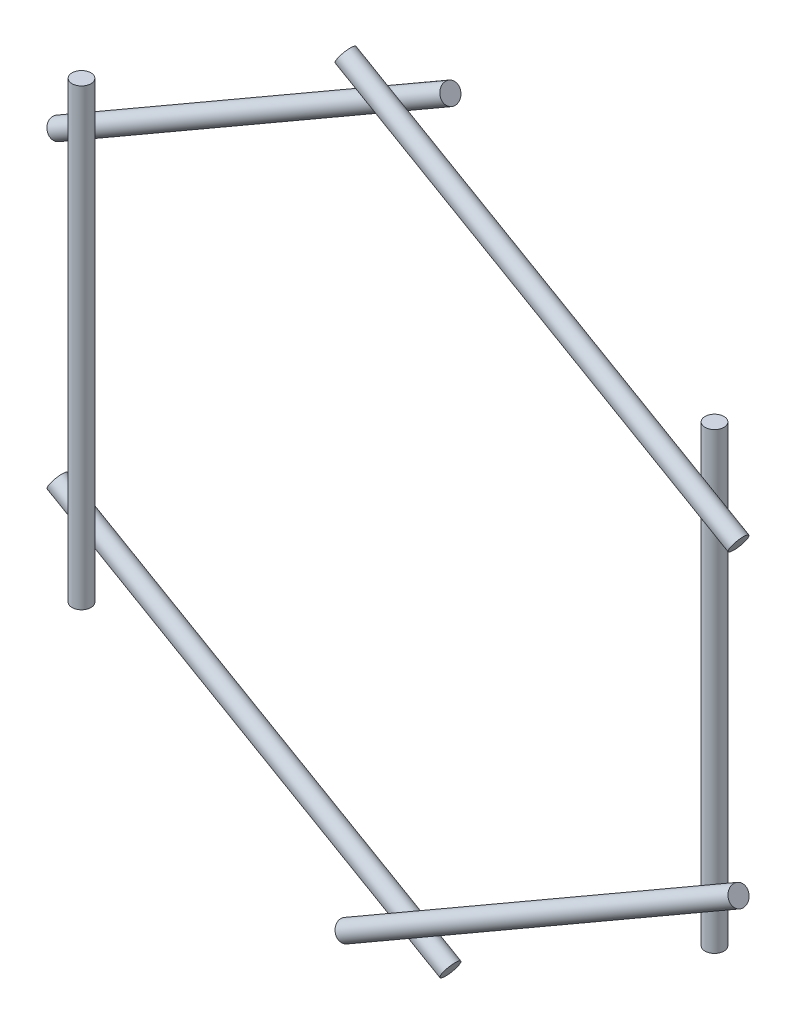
ISO-10303-21;
HEADER;
FILE_DESCRIPTION(('STEP AP214'),'2;1');
FILE_NAME('part.step','',(''),(''),'','','');
FILE_SCHEMA(('AUTOMOTIVE_DESIGN { 1 0 10303 214 1 1 1 1 }'));
ENDSEC;
DATA;
#1=APPLICATION_CONTEXT('core data for automotive mechanical design processes');
#2=APPLICATION_PROTOCOL_DEFINITION('international standard','automotive_design',2000,#1);
#3=PRODUCT_CONTEXT('',#1,'mechanical');
#4=PRODUCT('Part','Part','',(#3));
#5=PRODUCT_RELATED_PRODUCT_CATEGORY('part','',(#4));
#6=PRODUCT_DEFINITION_FORMATION('','',#4);
#7=PRODUCT_DEFINITION_CONTEXT('part definition',#1,'design');
#8=PRODUCT_DEFINITION('design','',#6,#7);
#9=PRODUCT_DEFINITION_SHAPE('','',#8);
#10=(LENGTH_UNIT() NAMED_UNIT(*) SI_UNIT(.MILLI.,.METRE.));
#11=(NAMED_UNIT(*) PLANE_ANGLE_UNIT() SI_UNIT($,.RADIAN.));
#12=(NAMED_UNIT(*) SI_UNIT($,.STERADIAN.) SOLID_ANGLE_UNIT());
#13=UNCERTAINTY_MEASURE_WITH_UNIT(LENGTH_MEASURE(1.E-05),#10,'distance_accuracy_value','');
#14=(GEOMETRIC_REPRESENTATION_CONTEXT(3) GLOBAL_UNCERTAINTY_ASSIGNED_CONTEXT((#13)) GLOBAL_UNIT_ASSIGNED_CONTEXT((#10,
#11,#12)) REPRESENTATION_CONTEXT('',''));
#15=CARTESIAN_POINT('',(0.,0.,0.));
#16=DIRECTION('',(0.,0.,1.));
#17=DIRECTION('',(1.,0.,0.));
#18=AXIS2_PLACEMENT_3D('',#15,#16,#17);
#19=CARTESIAN_POINT('',(-28.8415031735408,-254.845051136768,6.35));
#20=DIRECTION('',(0.866025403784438,0.500000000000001,0.));
#21=DIRECTION('',(-0.500000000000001,0.866025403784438,0.));
#22=AXIS2_PLACEMENT_3D('',#19,#20,#21);
#23=CYLINDRICAL_SURFACE('',#22,6.35);
#24=CARTESIAN_POINT('',(-28.8415031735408,-254.845051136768,6.35));
#25=DIRECTION('',(-0.866025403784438,-0.5,0.));
#26=DIRECTION('',(0.5,-0.866025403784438,0.));
#27=AXIS2_PLACEMENT_3D('',#24,#25,#26);
#28=CIRCLE('',#27,6.35);
#29=CARTESIAN_POINT('',(-25.6665031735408,-260.344312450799,6.35));
#30=VERTEX_POINT('',#29);
#31=EDGE_CURVE('E60',#30,#30,#28,.T.);
#32=ORIENTED_EDGE('',*,*,#31,.F.);
#33=EDGE_LOOP('',(#32));
#34=FACE_BOUND('',#33,.T.);
#35=CARTESIAN_POINT('',(235.123039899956,-102.445051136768,6.35));
#36=DIRECTION('',(-0.866025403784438,-0.5,0.));
#37=DIRECTION('',(0.5,-0.866025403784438,0.));
#38=AXIS2_PLACEMENT_3D('',#35,#36,#37);
#39=CIRCLE('',#38,6.35);
#40=CARTESIAN_POINT('',(238.298039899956,-107.944312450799,6.35));
#41=VERTEX_POINT('',#40);
#42=EDGE_CURVE('E11',#41,#41,#39,.T.);
#43=ORIENTED_EDGE('',*,*,#42,.T.);
#44=EDGE_LOOP('',(#43));
#45=FACE_BOUND('',#44,.T.);
#46=ADVANCED_FACE('F56',(#34,#45),#23,.T.);
#47=CARTESIAN_POINT('',(-28.8415031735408,-254.845051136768,6.35));
#48=DIRECTION('',(-0.866025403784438,-0.5,0.));
#49=DIRECTION('',(0.5,-0.866025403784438,0.));
#50=AXIS2_PLACEMENT_3D('',#47,#48,#49);
#51=PLANE('',#50);
#52=ORIENTED_EDGE('',*,*,#31,.T.);
#53=EDGE_LOOP('',(#52));
#54=FACE_BOUND('',#53,.T.);
#55=ADVANCED_FACE('F58',(#54),#51,.T.);
#56=CARTESIAN_POINT('',(235.123039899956,-102.445051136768,6.35));
#57=DIRECTION('',(-0.866025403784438,-0.5,0.));
#58=DIRECTION('',(0.5,-0.866025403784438,0.));
#59=AXIS2_PLACEMENT_3D('',#56,#57,#58);
#60=PLANE('',#59);
#61=ORIENTED_EDGE('',*,*,#42,.F.);
#62=EDGE_LOOP('',(#61));
#63=FACE_BOUND('',#62,.T.);
#64=ADVANCED_FACE('F81',(#63),#60,.F.);
#65=CLOSED_SHELL('',(#46,#55,#64));
#66=MANIFOLD_SOLID_BREP('B2',#65);
#67=CARTESIAN_POINT('',(-235.123039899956,102.445051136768,-6.35));
#68=DIRECTION('',(0.866025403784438,0.500000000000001,0.));
#69=DIRECTION('',(-0.500000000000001,0.866025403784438,0.));
#70=AXIS2_PLACEMENT_3D('',#67,#68,#69);
#71=CYLINDRICAL_SURFACE('',#70,6.35);
#72=CARTESIAN_POINT('',(-235.123039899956,102.445051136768,-6.35));
#73=DIRECTION('',(-0.866025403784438,-0.5,0.));
#74=DIRECTION('',(0.5,-0.866025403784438,0.));
#75=AXIS2_PLACEMENT_3D('',#72,#73,#74);
#76=CIRCLE('',#75,6.35);
#77=CARTESIAN_POINT('',(-231.948039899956,96.9457898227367,-6.35));
#78=VERTEX_POINT('',#77);
#79=EDGE_CURVE('E55',#78,#78,#76,.T.);
#80=ORIENTED_EDGE('',*,*,#79,.F.);
#81=EDGE_LOOP('',(#80));
#82=FACE_BOUND('',#81,.T.);
#83=CARTESIAN_POINT('',(28.8415031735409,254.845051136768,-6.35));
#84=DIRECTION('',(-0.866025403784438,-0.5,0.));
#85=DIRECTION('',(0.5,-0.866025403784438,0.));
#86=AXIS2_PLACEMENT_3D('',#83,#84,#85);
#87=CIRCLE('',#86,6.35);
#88=CARTESIAN_POINT('',(32.0165031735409,249.345789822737,-6.35));
#89=VERTEX_POINT('',#88);
#90=EDGE_CURVE('E113',#89,#89,#87,.T.);
#91=ORIENTED_EDGE('',*,*,#90,.T.);
#92=EDGE_LOOP('',(#91));
#93=FACE_BOUND('',#92,.T.);
#94=ADVANCED_FACE('F110',(#82,#93),#71,.T.);
#95=CARTESIAN_POINT('',(-235.123039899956,102.445051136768,-6.35));
#96=DIRECTION('',(-0.866025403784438,-0.5,0.));
#97=DIRECTION('',(0.5,-0.866025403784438,0.));
#98=AXIS2_PLACEMENT_3D('',#95,#96,#97);
#99=PLANE('',#98);
#100=ORIENTED_EDGE('',*,*,#79,.T.);
#101=EDGE_LOOP('',(#100));
#102=FACE_BOUND('',#101,.T.);
#103=ADVANCED_FACE('F129',(#102),#99,.T.);
#104=CARTESIAN_POINT('',(28.8415031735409,254.845051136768,-6.35));
#105=DIRECTION('',(-0.866025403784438,-0.5,0.));
#106=DIRECTION('',(0.5,-0.866025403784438,0.));
#107=AXIS2_PLACEMENT_3D('',#104,#105,#106);
#108=PLANE('',#107);
#109=ORIENTED_EDGE('',*,*,#90,.F.);
#110=EDGE_LOOP('',(#109));
#111=FACE_BOUND('',#110,.T.);
#112=ADVANCED_FACE('F127',(#111),#108,.F.);
#113=CLOSED_SHELL('',(#94,#103,#112));
#114=MANIFOLD_SOLID_BREP('B6',#113);
#115=CARTESIAN_POINT('',(-235.123039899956,-102.445051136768,-6.35));
#116=DIRECTION('',(0.866025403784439,-0.5,0.));
#117=DIRECTION('',(0.5,0.866025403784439,0.));
#118=AXIS2_PLACEMENT_3D('',#115,#116,#117);
#119=CYLINDRICAL_SURFACE('',#118,6.35);
#120=CARTESIAN_POINT('',(-235.123039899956,-102.445051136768,-6.35));
#121=DIRECTION('',(-0.866025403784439,0.5,0.));
#122=DIRECTION('',(-0.5,-0.866025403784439,0.));
#123=AXIS2_PLACEMENT_3D('',#120,#121,#122);
#124=CIRCLE('',#123,6.35);
#125=CARTESIAN_POINT('',(-238.298039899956,-107.944312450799,-6.35));
#126=VERTEX_POINT('',#125);
#127=EDGE_CURVE('E166',#126,#126,#124,.T.);
#128=ORIENTED_EDGE('',*,*,#127,.F.);
#129=EDGE_LOOP('',(#128));
#130=FACE_BOUND('',#129,.T.);
#131=CARTESIAN_POINT('',(28.8415031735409,-254.845051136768,-6.35));
#132=DIRECTION('',(-0.866025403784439,0.5,0.));
#133=DIRECTION('',(-0.5,-0.866025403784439,0.));
#134=AXIS2_PLACEMENT_3D('',#131,#132,#133);
#135=CIRCLE('',#134,6.35);
#136=CARTESIAN_POINT('',(25.6665031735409,-260.344312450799,-6.35));
#137=VERTEX_POINT('',#136);
#138=EDGE_CURVE('E109',#137,#137,#135,.T.);
#139=ORIENTED_EDGE('',*,*,#138,.T.);
#140=EDGE_LOOP('',(#139));
#141=FACE_BOUND('',#140,.T.);
#142=ADVANCED_FACE('F162',(#130,#141),#119,.T.);
#143=CARTESIAN_POINT('',(-235.123039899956,-102.445051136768,-6.35));
#144=DIRECTION('',(-0.866025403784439,0.5,0.));
#145=DIRECTION('',(-0.5,-0.866025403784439,0.));
#146=AXIS2_PLACEMENT_3D('',#143,#144,#145);
#147=PLANE('',#146);
#148=ORIENTED_EDGE('',*,*,#127,.T.);
#149=EDGE_LOOP('',(#148));
#150=FACE_BOUND('',#149,.T.);
#151=ADVANCED_FACE('F164',(#150),#147,.T.);
#152=CARTESIAN_POINT('',(28.8415031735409,-254.845051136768,-6.35));
#153=DIRECTION('',(-0.866025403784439,0.5,0.));
#154=DIRECTION('',(-0.5,-0.866025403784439,0.));
#155=AXIS2_PLACEMENT_3D('',#152,#153,#154);
#156=PLANE('',#155);
#157=ORIENTED_EDGE('',*,*,#138,.F.);
#158=EDGE_LOOP('',(#157));
#159=FACE_BOUND('',#158,.T.);
#160=ADVANCED_FACE('F185',(#159),#156,.F.);
#161=CLOSED_SHELL('',(#142,#151,#160));
#162=MANIFOLD_SOLID_BREP('B50',#161);
#163=CARTESIAN_POINT('',(-28.8415031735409,254.845051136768,6.35));
#164=DIRECTION('',(0.866025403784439,-0.5,0.));
#165=DIRECTION('',(0.5,0.866025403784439,0.));
#166=AXIS2_PLACEMENT_3D('',#163,#164,#165);
#167=CYLINDRICAL_SURFACE('',#166,6.35);
#168=CARTESIAN_POINT('',(-28.8415031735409,254.845051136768,6.35));
#169=DIRECTION('',(-0.866025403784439,0.5,0.));
#170=DIRECTION('',(-0.5,-0.866025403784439,0.));
#171=AXIS2_PLACEMENT_3D('',#168,#169,#170);
#172=CIRCLE('',#171,6.35);
#173=CARTESIAN_POINT('',(-32.0165031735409,249.345789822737,6.35));
#174=VERTEX_POINT('',#173);
#175=EDGE_CURVE('E161',#174,#174,#172,.T.);
#176=ORIENTED_EDGE('',*,*,#175,.F.);
#177=EDGE_LOOP('',(#176));
#178=FACE_BOUND('',#177,.T.);
#179=CARTESIAN_POINT('',(235.123039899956,102.445051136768,6.35));
#180=DIRECTION('',(-0.866025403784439,0.5,0.));
#181=DIRECTION('',(-0.5,-0.866025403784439,0.));
#182=AXIS2_PLACEMENT_3D('',#179,#180,#181);
#183=CIRCLE('',#182,6.35);
#184=CARTESIAN_POINT('',(231.948039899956,96.945789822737,6.35));
#185=VERTEX_POINT('',#184);
#186=EDGE_CURVE('E217',#185,#185,#183,.T.);
#187=ORIENTED_EDGE('',*,*,#186,.T.);
#188=EDGE_LOOP('',(#187));
#189=FACE_BOUND('',#188,.T.);
#190=ADVANCED_FACE('F214',(#178,#189),#167,.T.);
#191=CARTESIAN_POINT('',(-28.8415031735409,254.845051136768,6.35));
#192=DIRECTION('',(-0.866025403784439,0.5,0.));
#193=DIRECTION('',(-0.5,-0.866025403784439,0.));
#194=AXIS2_PLACEMENT_3D('',#191,#192,#193);
#195=PLANE('',#194);
#196=ORIENTED_EDGE('',*,*,#175,.T.);
#197=EDGE_LOOP('',(#196));
#198=FACE_BOUND('',#197,.T.);
#199=ADVANCED_FACE('F233',(#198),#195,.T.);
#200=CARTESIAN_POINT('',(235.123039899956,102.445051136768,6.35));
#201=DIRECTION('',(-0.866025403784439,0.5,0.));
#202=DIRECTION('',(-0.5,-0.866025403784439,0.));
#203=AXIS2_PLACEMENT_3D('',#200,#201,#202);
#204=PLANE('',#203);
#205=ORIENTED_EDGE('',*,*,#186,.F.);
#206=EDGE_LOOP('',(#205));
#207=FACE_BOUND('',#206,.T.);
#208=ADVANCED_FACE('F231',(#207),#204,.F.);
#209=CLOSED_SHELL('',(#190,#199,#208));
#210=MANIFOLD_SOLID_BREP('B104',#209);
#211=CARTESIAN_POINT('',(-206.281536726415,152.4,6.35));
#212=DIRECTION('',(0.,-1.,0.));
#213=DIRECTION('',(0.,0.,-1.));
#214=AXIS2_PLACEMENT_3D('',#211,#212,#213);
#215=CYLINDRICAL_SURFACE('',#214,6.35);
#216=CARTESIAN_POINT('',(-206.281536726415,152.4,6.35));
#217=DIRECTION('',(0.,1.,0.));
#218=DIRECTION('',(0.,0.,1.));
#219=AXIS2_PLACEMENT_3D('',#216,#217,#218);
#220=CIRCLE('',#219,6.35);
#221=CARTESIAN_POINT('',(-206.281536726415,152.4,0.));
#222=VERTEX_POINT('',#221);
#223=EDGE_CURVE('E269',#222,#222,#220,.T.);
#224=CARTESIAN_POINT('',(-206.281536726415,-152.4,6.35));
#225=DIRECTION('',(0.,1.,0.));
#226=DIRECTION('',(0.,0.,1.));
#227=AXIS2_PLACEMENT_3D('',#224,#225,#226);
#228=CIRCLE('',#227,6.35);
#229=CARTESIAN_POINT('',(-206.281536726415,-152.4,0.));
#230=VERTEX_POINT('',#229);
#231=EDGE_CURVE('E213',#230,#230,#228,.T.);
#232=CARTESIAN_POINT('',(-206.281536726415,152.4,0.));
#233=CARTESIAN_POINT('',(-206.281536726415,149.225,0.));
#234=CARTESIAN_POINT('',(-206.281536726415,146.05,0.));
#235=CARTESIAN_POINT('',(-206.281536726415,139.7,0.));
#236=CARTESIAN_POINT('',(-206.281536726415,136.525,0.));
#237=CARTESIAN_POINT('',(-206.281536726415,130.175,0.));
#238=CARTESIAN_POINT('',(-206.281536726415,127.,0.));
#239=CARTESIAN_POINT('',(-206.281536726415,120.65,0.));
#240=CARTESIAN_POINT('',(-206.281536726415,117.475,0.));
#241=CARTESIAN_POINT('',(-206.281536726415,111.125,0.));
#242=CARTESIAN_POINT('',(-206.281536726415,107.95,0.));
#243=CARTESIAN_POINT('',(-206.281536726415,101.6,0.));
#244=CARTESIAN_POINT('',(-206.281536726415,98.425,0.));
#245=CARTESIAN_POINT('',(-206.281536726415,92.075,0.));
#246=CARTESIAN_POINT('',(-206.281536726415,88.9,0.));
#247=CARTESIAN_POINT('',(-206.281536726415,82.55,0.));
#248=CARTESIAN_POINT('',(-206.281536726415,79.375,0.));
#249=CARTESIAN_POINT('',(-206.281536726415,73.025,0.));
#250=CARTESIAN_POINT('',(-206.281536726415,69.85,0.));
#251=CARTESIAN_POINT('',(-206.281536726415,63.5,0.));
#252=CARTESIAN_POINT('',(-206.281536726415,60.325,0.));
#253=CARTESIAN_POINT('',(-206.281536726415,53.975,0.));
#254=CARTESIAN_POINT('',(-206.281536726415,50.8,0.));
#255=CARTESIAN_POINT('',(-206.281536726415,44.45,0.));
#256=CARTESIAN_POINT('',(-206.281536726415,41.275,0.));
#257=CARTESIAN_POINT('',(-206.281536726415,34.925,0.));
#258=CARTESIAN_POINT('',(-206.281536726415,31.75,0.));
#259=CARTESIAN_POINT('',(-206.281536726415,25.4,0.));
#260=CARTESIAN_POINT('',(-206.281536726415,22.225,0.));
#261=CARTESIAN_POINT('',(-206.281536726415,15.875,0.));
#262=CARTESIAN_POINT('',(-206.281536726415,12.7,0.));
#263=CARTESIAN_POINT('',(-206.281536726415,6.35,0.));
#264=CARTESIAN_POINT('',(-206.281536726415,3.175,0.));
#265=CARTESIAN_POINT('',(-206.281536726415,-3.175,0.));
#266=CARTESIAN_POINT('',(-206.281536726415,-6.35,0.));
#267=CARTESIAN_POINT('',(-206.281536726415,-12.7,0.));
#268=CARTESIAN_POINT('',(-206.281536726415,-15.875,0.));
#269=CARTESIAN_POINT('',(-206.281536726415,-22.225,0.));
#270=CARTESIAN_POINT('',(-206.281536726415,-25.4,0.));
#271=CARTESIAN_POINT('',(-206.281536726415,-31.75,0.));
#272=CARTESIAN_POINT('',(-206.281536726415,-34.925,0.));
#273=CARTESIAN_POINT('',(-206.281536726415,-41.275,0.));
#274=CARTESIAN_POINT('',(-206.281536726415,-44.45,0.));
#275=CARTESIAN_POINT('',(-206.281536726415,-50.8,0.));
#276=CARTESIAN_POINT('',(-206.281536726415,-53.975,0.));
#277=CARTESIAN_POINT('',(-206.281536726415,-60.325,0.));
#278=CARTESIAN_POINT('',(-206.281536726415,-63.5,0.));
#279=CARTESIAN_POINT('',(-206.281536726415,-69.85,0.));
#280=CARTESIAN_POINT('',(-206.281536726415,-73.025,0.));
#281=CARTESIAN_POINT('',(-206.281536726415,-79.375,0.));
#282=CARTESIAN_POINT('',(-206.281536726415,-82.55,0.));
#283=CARTESIAN_POINT('',(-206.281536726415,-88.9,0.));
#284=CARTESIAN_POINT('',(-206.281536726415,-92.075,0.));
#285=CARTESIAN_POINT('',(-206.281536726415,-98.425,0.));
#286=CARTESIAN_POINT('',(-206.281536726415,-101.6,0.));
#287=CARTESIAN_POINT('',(-206.281536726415,-107.95,0.));
#288=CARTESIAN_POINT('',(-206.281536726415,-111.125,0.));
#289=CARTESIAN_POINT('',(-206.281536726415,-117.475,0.));
#290=CARTESIAN_POINT('',(-206.281536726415,-120.65,0.));
#291=CARTESIAN_POINT('',(-206.281536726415,-127.,0.));
#292=CARTESIAN_POINT('',(-206.281536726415,-130.175,0.));
#293=CARTESIAN_POINT('',(-206.281536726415,-136.525,0.));
#294=CARTESIAN_POINT('',(-206.281536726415,-139.7,0.));
#295=CARTESIAN_POINT('',(-206.281536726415,-146.05,0.));
#296=CARTESIAN_POINT('',(-206.281536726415,-149.225,0.));
#297=CARTESIAN_POINT('',(-206.281536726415,-152.4,0.));
#298=B_SPLINE_CURVE_WITH_KNOTS('',3,(#232,#233,#234,#235,#236,#237,#238,#239,#240,#241,#242,
#243,#244,#245,#246,#247,#248,#249,#250,#251,#252,#253,#254,#255,#256,#257,#258,#259,#260,#261,
#262,#263,#264,#265,#266,#267,#268,#269,#270,#271,#272,#273,#274,#275,#276,#277,#278,#279,#280,
#281,#282,#283,#284,#285,#286,#287,#288,#289,#290,#291,#292,#293,#294,#295,#296,#297),
.UNSPECIFIED.,.F.,.F.,(4,2,2,2,2,2,2,2,2,2,2,2,2,2,2,2,2,2,2,2,2,2,2,2,2,2,2,2,2,2,2,2,4),(0.,
9.52500000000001,19.05,28.575,38.1,47.625,57.15,66.675,76.2,85.725,95.25,104.775,114.3,123.825,
133.35,142.875,152.4,161.925,171.45,180.975,190.5,200.025,209.55,219.075,228.6,238.125,247.65,
257.175,266.7,276.225,285.75,295.275,304.8),.UNSPECIFIED.);
#299=EDGE_CURVE('BSEAM265',#222,#230,#298,.T.);
#300=ORIENTED_EDGE('',*,*,#223,.F.);
#301=ORIENTED_EDGE('',*,*,#231,.T.);
#302=ORIENTED_EDGE('',*,*,#299,.T.);
#303=ORIENTED_EDGE('',*,*,#299,.F.);
#304=EDGE_LOOP('',(#300,#302,#301,#303));
#305=FACE_BOUND('',#304,.T.);
#306=ADVANCED_FACE('F265',(#305),#215,.T.);
#307=CARTESIAN_POINT('',(-206.281536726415,152.4,6.35));
#308=DIRECTION('',(0.,1.,0.));
#309=DIRECTION('',(0.,0.,1.));
#310=AXIS2_PLACEMENT_3D('',#307,#308,#309);
#311=PLANE('',#310);
#312=ORIENTED_EDGE('',*,*,#223,.T.);
#313=EDGE_LOOP('',(#312));
#314=FACE_BOUND('',#313,.T.);
#315=ADVANCED_FACE('F267',(#314),#311,.T.);
#316=CARTESIAN_POINT('',(-206.281536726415,-152.4,6.35));
#317=DIRECTION('',(0.,1.,0.));
#318=DIRECTION('',(0.,0.,1.));
#319=AXIS2_PLACEMENT_3D('',#316,#317,#318);
#320=PLANE('',#319);
#321=ORIENTED_EDGE('',*,*,#231,.F.);
#322=EDGE_LOOP('',(#321));
#323=FACE_BOUND('',#322,.T.);
#324=ADVANCED_FACE('F288',(#323),#320,.F.);
#325=CLOSED_SHELL('',(#306,#315,#324));
#326=MANIFOLD_SOLID_BREP('B156',#325);
#327=CARTESIAN_POINT('',(206.281536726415,152.4,-6.35));
#328=DIRECTION('',(0.,-1.,0.));
#329=DIRECTION('',(0.,0.,-1.));
#330=AXIS2_PLACEMENT_3D('',#327,#328,#329);
#331=CYLINDRICAL_SURFACE('',#330,6.35);
#332=CARTESIAN_POINT('',(206.281536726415,152.4,-6.35));
#333=DIRECTION('',(0.,1.,0.));
#334=DIRECTION('',(0.,0.,1.));
#335=AXIS2_PLACEMENT_3D('',#332,#333,#334);
#336=CIRCLE('',#335,6.35);
#337=CARTESIAN_POINT('',(206.281536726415,152.4,-12.7));
#338=VERTEX_POINT('',#337);
#339=EDGE_CURVE('E264',#338,#338,#336,.T.);
#340=CARTESIAN_POINT('',(206.281536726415,-152.4,-6.35));
#341=DIRECTION('',(0.,1.,0.));
#342=DIRECTION('',(0.,0.,1.));
#343=AXIS2_PLACEMENT_3D('',#340,#341,#342);
#344=CIRCLE('',#343,6.35);
#345=CARTESIAN_POINT('',(206.281536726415,-152.4,-12.7));
#346=VERTEX_POINT('',#345);
#347=EDGE_CURVE('E312',#346,#346,#344,.T.);
#348=CARTESIAN_POINT('',(206.281536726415,152.4,-12.7));
#349=CARTESIAN_POINT('',(206.281536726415,149.225,-12.7));
#350=CARTESIAN_POINT('',(206.281536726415,146.05,-12.7));
#351=CARTESIAN_POINT('',(206.281536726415,139.7,-12.7));
#352=CARTESIAN_POINT('',(206.281536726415,136.525,-12.7));
#353=CARTESIAN_POINT('',(206.281536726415,130.175,-12.7));
#354=CARTESIAN_POINT('',(206.281536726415,127.,-12.7));
#355=CARTESIAN_POINT('',(206.281536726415,120.65,-12.7));
#356=CARTESIAN_POINT('',(206.281536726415,117.475,-12.7));
#357=CARTESIAN_POINT('',(206.281536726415,111.125,-12.7));
#358=CARTESIAN_POINT('',(206.281536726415,107.95,-12.7));
#359=CARTESIAN_POINT('',(206.281536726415,101.6,-12.7));
#360=CARTESIAN_POINT('',(206.281536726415,98.425,-12.7));
#361=CARTESIAN_POINT('',(206.281536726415,92.075,-12.7));
#362=CARTESIAN_POINT('',(206.281536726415,88.9,-12.7));
#363=CARTESIAN_POINT('',(206.281536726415,82.55,-12.7));
#364=CARTESIAN_POINT('',(206.281536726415,79.375,-12.7));
#365=CARTESIAN_POINT('',(206.281536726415,73.025,-12.7));
#366=CARTESIAN_POINT('',(206.281536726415,69.85,-12.7));
#367=CARTESIAN_POINT('',(206.281536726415,63.5,-12.7));
#368=CARTESIAN_POINT('',(206.281536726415,60.325,-12.7));
#369=CARTESIAN_POINT('',(206.281536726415,53.975,-12.7));
#370=CARTESIAN_POINT('',(206.281536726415,50.8,-12.7));
#371=CARTESIAN_POINT('',(206.281536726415,44.45,-12.7));
#372=CARTESIAN_POINT('',(206.281536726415,41.275,-12.7));
#373=CARTESIAN_POINT('',(206.281536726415,34.925,-12.7));
#374=CARTESIAN_POINT('',(206.281536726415,31.75,-12.7));
#375=CARTESIAN_POINT('',(206.281536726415,25.4,-12.7));
#376=CARTESIAN_POINT('',(206.281536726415,22.225,-12.7));
#377=CARTESIAN_POINT('',(206.281536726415,15.875,-12.7));
#378=CARTESIAN_POINT('',(206.281536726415,12.7,-12.7));
#379=CARTESIAN_POINT('',(206.281536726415,6.35,-12.7));
#380=CARTESIAN_POINT('',(206.281536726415,3.175,-12.7));
#381=CARTESIAN_POINT('',(206.281536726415,-3.175,-12.7));
#382=CARTESIAN_POINT('',(206.281536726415,-6.35,-12.7));
#383=CARTESIAN_POINT('',(206.281536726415,-12.7,-12.7));
#384=CARTESIAN_POINT('',(206.281536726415,-15.875,-12.7));
#385=CARTESIAN_POINT('',(206.281536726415,-22.225,-12.7));
#386=CARTESIAN_POINT('',(206.281536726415,-25.4,-12.7));
#387=CARTESIAN_POINT('',(206.281536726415,-31.75,-12.7));
#388=CARTESIAN_POINT('',(206.281536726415,-34.925,-12.7));
#389=CARTESIAN_POINT('',(206.281536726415,-41.275,-12.7));
#390=CARTESIAN_POINT('',(206.281536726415,-44.45,-12.7));
#391=CARTESIAN_POINT('',(206.281536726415,-50.8,-12.7));
#392=CARTESIAN_POINT('',(206.281536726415,-53.975,-12.7));
#393=CARTESIAN_POINT('',(206.281536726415,-60.325,-12.7));
#394=CARTESIAN_POINT('',(206.281536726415,-63.5,-12.7));
#395=CARTESIAN_POINT('',(206.281536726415,-69.85,-12.7));
#396=CARTESIAN_POINT('',(206.281536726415,-73.025,-12.7));
#397=CARTESIAN_POINT('',(206.281536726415,-79.375,-12.7));
#398=CARTESIAN_POINT('',(206.281536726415,-82.55,-12.7));
#399=CARTESIAN_POINT('',(206.281536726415,-88.9,-12.7));
#400=CARTESIAN_POINT('',(206.281536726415,-92.075,-12.7));
#401=CARTESIAN_POINT('',(206.281536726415,-98.425,-12.7));
#402=CARTESIAN_POINT('',(206.281536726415,-101.6,-12.7));
#403=CARTESIAN_POINT('',(206.281536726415,-107.95,-12.7));
#404=CARTESIAN_POINT('',(206.281536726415,-111.125,-12.7));
#405=CARTESIAN_POINT('',(206.281536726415,-117.475,-12.7));
#406=CARTESIAN_POINT('',(206.281536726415,-120.65,-12.7));
#407=CARTESIAN_POINT('',(206.281536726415,-127.,-12.7));
#408=CARTESIAN_POINT('',(206.281536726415,-130.175,-12.7));
#409=CARTESIAN_POINT('',(206.281536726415,-136.525,-12.7));
#410=CARTESIAN_POINT('',(206.281536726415,-139.7,-12.7));
#411=CARTESIAN_POINT('',(206.281536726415,-146.05,-12.7));
#412=CARTESIAN_POINT('',(206.281536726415,-149.225,-12.7));
#413=CARTESIAN_POINT('',(206.281536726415,-152.4,-12.7));
#414=B_SPLINE_CURVE_WITH_KNOTS('',3,(#348,#349,#350,#351,#352,#353,#354,#355,#356,#357,#358,
#359,#360,#361,#362,#363,#364,#365,#366,#367,#368,#369,#370,#371,#372,#373,#374,#375,#376,#377,
#378,#379,#380,#381,#382,#383,#384,#385,#386,#387,#388,#389,#390,#391,#392,#393,#394,#395,#396,
#397,#398,#399,#400,#401,#402,#403,#404,#405,#406,#407,#408,#409,#410,#411,#412,#413),
.UNSPECIFIED.,.F.,.F.,(4,2,2,2,2,2,2,2,2,2,2,2,2,2,2,2,2,2,2,2,2,2,2,2,2,2,2,2,2,2,2,2,4),(0.,
9.52500000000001,19.05,28.575,38.1,47.625,57.15,66.675,76.2,85.725,95.25,104.775,114.3,123.825,
133.35,142.875,152.4,161.925,171.45,180.975,190.5,200.025,209.55,219.075,228.6,238.125,247.65,
257.175,266.7,276.225,285.75,295.275,304.8),.UNSPECIFIED.);
#415=EDGE_CURVE('BSEAM309',#338,#346,#414,.T.);
#416=ORIENTED_EDGE('',*,*,#339,.F.);
#417=ORIENTED_EDGE('',*,*,#347,.T.);
#418=ORIENTED_EDGE('',*,*,#415,.T.);
#419=ORIENTED_EDGE('',*,*,#415,.F.);
#420=EDGE_LOOP('',(#416,#418,#417,#419));
#421=FACE_BOUND('',#420,.T.);
#422=ADVANCED_FACE('F309',(#421),#331,.T.);
#423=CARTESIAN_POINT('',(206.281536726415,152.4,-6.35));
#424=DIRECTION('',(0.,1.,0.));
#425=DIRECTION('',(0.,0.,1.));
#426=AXIS2_PLACEMENT_3D('',#423,#424,#425);
#427=PLANE('',#426);
#428=ORIENTED_EDGE('',*,*,#339,.T.);
#429=EDGE_LOOP('',(#428));
#430=FACE_BOUND('',#429,.T.);
#431=ADVANCED_FACE('F328',(#430),#427,.T.);
#432=CARTESIAN_POINT('',(206.281536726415,-152.4,-6.35));
#433=DIRECTION('',(0.,1.,0.));
#434=DIRECTION('',(0.,0.,1.));
#435=AXIS2_PLACEMENT_3D('',#432,#433,#434);
#436=PLANE('',#435);
#437=ORIENTED_EDGE('',*,*,#347,.F.);
#438=EDGE_LOOP('',(#437));
#439=FACE_BOUND('',#438,.T.);
#440=ADVANCED_FACE('F326',(#439),#436,.F.);
#441=CLOSED_SHELL('',(#422,#431,#440));
#442=MANIFOLD_SOLID_BREP('B208',#441);
#443=ADVANCED_BREP_SHAPE_REPRESENTATION('',(#18,#66,#114,#162,#210,#326,#442),#14);
#444=SHAPE_DEFINITION_REPRESENTATION(#9,#443);
ENDSEC;
END-ISO-10303-21;
